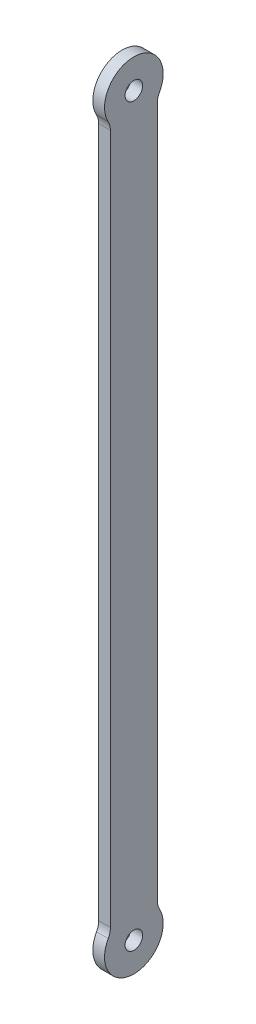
ISO-10303-21;
HEADER;
FILE_DESCRIPTION(('STEP AP214'),'2;1');
FILE_NAME('part.step','',(''),(''),'','','');
FILE_SCHEMA(('AUTOMOTIVE_DESIGN { 1 0 10303 214 1 1 1 1 }'));
ENDSEC;
DATA;
#1=APPLICATION_CONTEXT('core data for automotive mechanical design processes');
#2=APPLICATION_PROTOCOL_DEFINITION('international standard','automotive_design',2000,#1);
#3=PRODUCT_CONTEXT('',#1,'mechanical');
#4=PRODUCT('Part','Part','',(#3));
#5=PRODUCT_RELATED_PRODUCT_CATEGORY('part','',(#4));
#6=PRODUCT_DEFINITION_FORMATION('','',#4);
#7=PRODUCT_DEFINITION_CONTEXT('part definition',#1,'design');
#8=PRODUCT_DEFINITION('design','',#6,#7);
#9=PRODUCT_DEFINITION_SHAPE('','',#8);
#10=(LENGTH_UNIT() NAMED_UNIT(*) SI_UNIT(.MILLI.,.METRE.));
#11=(NAMED_UNIT(*) PLANE_ANGLE_UNIT() SI_UNIT($,.RADIAN.));
#12=(NAMED_UNIT(*) SI_UNIT($,.STERADIAN.) SOLID_ANGLE_UNIT());
#13=UNCERTAINTY_MEASURE_WITH_UNIT(LENGTH_MEASURE(1.E-05),#10,'distance_accuracy_value','');
#14=(GEOMETRIC_REPRESENTATION_CONTEXT(3) GLOBAL_UNCERTAINTY_ASSIGNED_CONTEXT((#13)) GLOBAL_UNIT_ASSIGNED_CONTEXT((#10,
#11,#12)) REPRESENTATION_CONTEXT('',''));
#15=CARTESIAN_POINT('',(0.,0.,0.));
#16=DIRECTION('',(0.,0.,1.));
#17=DIRECTION('',(1.,0.,0.));
#18=AXIS2_PLACEMENT_3D('',#15,#16,#17);
#19=CARTESIAN_POINT('',(2.,0.,0.));
#20=DIRECTION('',(1.,0.,0.));
#21=DIRECTION('',(0.,0.,-1.));
#22=AXIS2_PLACEMENT_3D('',#19,#20,#21);
#23=PLANE('',#22);
#24=CARTESIAN_POINT('',(2.,125.52,0.));
#25=DIRECTION('',(1.,0.,0.));
#26=DIRECTION('',(0.,0.,-1.));
#27=AXIS2_PLACEMENT_3D('',#24,#25,#26);
#28=CIRCLE('',#27,5.);
#29=CARTESIAN_POINT('',(2.,123.09938540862,-4.375));
#30=VERTEX_POINT('',#29);
#31=CARTESIAN_POINT('',(2.,123.09938540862,4.375));
#32=VERTEX_POINT('',#31);
#33=EDGE_CURVE('E191',#30,#32,#28,.T.);
#34=ORIENTED_EDGE('',*,*,#33,.T.);
#35=CARTESIAN_POINT('',(2.,121.647016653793,7.));
#36=DIRECTION('',(1.,0.,0.));
#37=DIRECTION('',(0.,0.,-1.));
#38=AXIS2_PLACEMENT_3D('',#35,#36,#37);
#39=CIRCLE('',#38,3.);
#40=CARTESIAN_POINT('',(2.,121.647016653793,4.));
#41=VERTEX_POINT('',#40);
#42=EDGE_CURVE('E11',#32,#41,#39,.F.);
#43=ORIENTED_EDGE('',*,*,#42,.T.);
#44=DIRECTION('',(0.,-1.,0.));
#45=VECTOR('',#44,1.);
#46=CARTESIAN_POINT('',(2.,0.,4.));
#47=LINE('',#46,#45);
#48=CARTESIAN_POINT('',(2.,3.87298334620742,4.));
#49=VERTEX_POINT('',#48);
#50=EDGE_CURVE('E123',#41,#49,#47,.T.);
#51=ORIENTED_EDGE('',*,*,#50,.T.);
#52=CARTESIAN_POINT('',(2.,3.87298334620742,7.));
#53=DIRECTION('',(1.,0.,0.));
#54=DIRECTION('',(0.,0.,-1.));
#55=AXIS2_PLACEMENT_3D('',#52,#53,#54);
#56=CIRCLE('',#55,3.);
#57=CARTESIAN_POINT('',(2.,2.42061459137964,4.375));
#58=VERTEX_POINT('',#57);
#59=EDGE_CURVE('E166',#49,#58,#56,.F.);
#60=ORIENTED_EDGE('',*,*,#59,.T.);
#61=CARTESIAN_POINT('',(2.,0.,0.));
#62=DIRECTION('',(1.,0.,0.));
#63=DIRECTION('',(0.,0.,-1.));
#64=AXIS2_PLACEMENT_3D('',#61,#62,#63);
#65=CIRCLE('',#64,5.);
#66=CARTESIAN_POINT('',(2.,2.42061459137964,-4.375));
#67=VERTEX_POINT('',#66);
#68=EDGE_CURVE('E193',#58,#67,#65,.T.);
#69=ORIENTED_EDGE('',*,*,#68,.T.);
#70=CARTESIAN_POINT('',(2.,3.87298334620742,-7.));
#71=DIRECTION('',(1.,0.,0.));
#72=DIRECTION('',(0.,0.,-1.));
#73=AXIS2_PLACEMENT_3D('',#70,#71,#72);
#74=CIRCLE('',#73,3.);
#75=CARTESIAN_POINT('',(2.,3.87298334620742,-4.));
#76=VERTEX_POINT('',#75);
#77=EDGE_CURVE('E174',#67,#76,#74,.F.);
#78=ORIENTED_EDGE('',*,*,#77,.T.);
#79=DIRECTION('',(0.,1.,0.));
#80=VECTOR('',#79,1.);
#81=CARTESIAN_POINT('',(2.,0.,-4.));
#82=LINE('',#81,#80);
#83=CARTESIAN_POINT('',(2.,121.647016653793,-4.));
#84=VERTEX_POINT('',#83);
#85=EDGE_CURVE('E134',#76,#84,#82,.T.);
#86=ORIENTED_EDGE('',*,*,#85,.T.);
#87=CARTESIAN_POINT('',(2.,121.647016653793,-7.));
#88=DIRECTION('',(1.,0.,0.));
#89=DIRECTION('',(0.,0.,-1.));
#90=AXIS2_PLACEMENT_3D('',#87,#88,#89);
#91=CIRCLE('',#90,3.);
#92=EDGE_CURVE('E65',#84,#30,#91,.F.);
#93=ORIENTED_EDGE('',*,*,#92,.T.);
#94=EDGE_LOOP('',(#34,#43,#51,#60,#69,#78,#86,#93));
#95=FACE_BOUND('',#94,.T.);
#96=CARTESIAN_POINT('',(2.,125.52,0.));
#97=DIRECTION('',(1.,0.,0.));
#98=DIRECTION('',(0.,0.,-1.));
#99=AXIS2_PLACEMENT_3D('',#96,#97,#98);
#100=CIRCLE('',#99,1.5);
#101=CARTESIAN_POINT('',(2.,125.52,-1.5));
#102=VERTEX_POINT('',#101);
#103=EDGE_CURVE('E141',#102,#102,#100,.T.);
#104=ORIENTED_EDGE('',*,*,#103,.F.);
#105=EDGE_LOOP('',(#104));
#106=FACE_BOUND('',#105,.T.);
#107=CARTESIAN_POINT('',(2.,0.,0.));
#108=DIRECTION('',(1.,0.,0.));
#109=DIRECTION('',(0.,0.,-1.));
#110=AXIS2_PLACEMENT_3D('',#107,#108,#109);
#111=CIRCLE('',#110,1.5);
#112=CARTESIAN_POINT('',(2.,0.,-1.5));
#113=VERTEX_POINT('',#112);
#114=EDGE_CURVE('E204',#113,#113,#111,.T.);
#115=ORIENTED_EDGE('',*,*,#114,.F.);
#116=EDGE_LOOP('',(#115));
#117=FACE_BOUND('',#116,.T.);
#118=ADVANCED_FACE('F42',(#95,#106,#117),#23,.T.);
#119=CARTESIAN_POINT('',(0.,0.,0.));
#120=DIRECTION('',(1.,0.,0.));
#121=DIRECTION('',(0.,0.,-1.));
#122=AXIS2_PLACEMENT_3D('',#119,#120,#121);
#123=PLANE('',#122);
#124=DIRECTION('',(0.,1.,0.));
#125=VECTOR('',#124,1.);
#126=CARTESIAN_POINT('',(0.,0.,-4.));
#127=LINE('',#126,#125);
#128=CARTESIAN_POINT('',(0.,3.87298334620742,-4.));
#129=VERTEX_POINT('',#128);
#130=CARTESIAN_POINT('',(0.,121.647016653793,-4.));
#131=VERTEX_POINT('',#130);
#132=EDGE_CURVE('E135',#129,#131,#127,.T.);
#133=ORIENTED_EDGE('',*,*,#132,.F.);
#134=CARTESIAN_POINT('',(0.,3.87298334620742,-7.));
#135=DIRECTION('',(1.,0.,0.));
#136=DIRECTION('',(0.,0.,-1.));
#137=AXIS2_PLACEMENT_3D('',#134,#135,#136);
#138=CIRCLE('',#137,3.);
#139=CARTESIAN_POINT('',(0.,2.42061459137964,-4.375));
#140=VERTEX_POINT('',#139);
#141=EDGE_CURVE('E171',#129,#140,#138,.T.);
#142=ORIENTED_EDGE('',*,*,#141,.T.);
#143=CARTESIAN_POINT('',(0.,0.,0.));
#144=DIRECTION('',(1.,0.,0.));
#145=DIRECTION('',(0.,0.,-1.));
#146=AXIS2_PLACEMENT_3D('',#143,#144,#145);
#147=CIRCLE('',#146,5.);
#148=CARTESIAN_POINT('',(0.,2.42061459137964,4.375));
#149=VERTEX_POINT('',#148);
#150=EDGE_CURVE('E200',#140,#149,#147,.F.);
#151=ORIENTED_EDGE('',*,*,#150,.T.);
#152=CARTESIAN_POINT('',(0.,3.87298334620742,7.));
#153=DIRECTION('',(1.,0.,0.));
#154=DIRECTION('',(0.,0.,-1.));
#155=AXIS2_PLACEMENT_3D('',#152,#153,#154);
#156=CIRCLE('',#155,3.);
#157=CARTESIAN_POINT('',(0.,3.87298334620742,4.));
#158=VERTEX_POINT('',#157);
#159=EDGE_CURVE('E132',#149,#158,#156,.T.);
#160=ORIENTED_EDGE('',*,*,#159,.T.);
#161=DIRECTION('',(0.,-1.,0.));
#162=VECTOR('',#161,1.);
#163=CARTESIAN_POINT('',(0.,0.,4.));
#164=LINE('',#163,#162);
#165=CARTESIAN_POINT('',(0.,121.647016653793,4.));
#166=VERTEX_POINT('',#165);
#167=EDGE_CURVE('E120',#166,#158,#164,.T.);
#168=ORIENTED_EDGE('',*,*,#167,.F.);
#169=CARTESIAN_POINT('',(0.,121.647016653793,7.));
#170=DIRECTION('',(1.,0.,0.));
#171=DIRECTION('',(0.,0.,-1.));
#172=AXIS2_PLACEMENT_3D('',#169,#170,#171);
#173=CIRCLE('',#172,3.);
#174=CARTESIAN_POINT('',(0.,123.09938540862,4.375));
#175=VERTEX_POINT('',#174);
#176=EDGE_CURVE('E51',#166,#175,#173,.T.);
#177=ORIENTED_EDGE('',*,*,#176,.T.);
#178=CARTESIAN_POINT('',(0.,125.52,0.));
#179=DIRECTION('',(1.,0.,0.));
#180=DIRECTION('',(0.,0.,-1.));
#181=AXIS2_PLACEMENT_3D('',#178,#179,#180);
#182=CIRCLE('',#181,5.);
#183=CARTESIAN_POINT('',(0.,123.09938540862,-4.375));
#184=VERTEX_POINT('',#183);
#185=EDGE_CURVE('E181',#175,#184,#182,.F.);
#186=ORIENTED_EDGE('',*,*,#185,.T.);
#187=CARTESIAN_POINT('',(0.,121.647016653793,-7.));
#188=DIRECTION('',(1.,0.,0.));
#189=DIRECTION('',(0.,0.,-1.));
#190=AXIS2_PLACEMENT_3D('',#187,#188,#189);
#191=CIRCLE('',#190,3.);
#192=EDGE_CURVE('E114',#184,#131,#191,.T.);
#193=ORIENTED_EDGE('',*,*,#192,.T.);
#194=EDGE_LOOP('',(#133,#142,#151,#160,#168,#177,#186,#193));
#195=FACE_BOUND('',#194,.T.);
#196=CARTESIAN_POINT('',(0.,125.52,0.));
#197=DIRECTION('',(1.,0.,0.));
#198=DIRECTION('',(0.,0.,-1.));
#199=AXIS2_PLACEMENT_3D('',#196,#197,#198);
#200=CIRCLE('',#199,1.5);
#201=CARTESIAN_POINT('',(0.,125.52,-1.5));
#202=VERTEX_POINT('',#201);
#203=EDGE_CURVE('E208',#202,#202,#200,.T.);
#204=ORIENTED_EDGE('',*,*,#203,.T.);
#205=EDGE_LOOP('',(#204));
#206=FACE_BOUND('',#205,.T.);
#207=CARTESIAN_POINT('',(0.,0.,0.));
#208=DIRECTION('',(1.,0.,0.));
#209=DIRECTION('',(0.,0.,-1.));
#210=AXIS2_PLACEMENT_3D('',#207,#208,#209);
#211=CIRCLE('',#210,1.5);
#212=CARTESIAN_POINT('',(0.,0.,-1.5));
#213=VERTEX_POINT('',#212);
#214=EDGE_CURVE('E197',#213,#213,#211,.T.);
#215=ORIENTED_EDGE('',*,*,#214,.T.);
#216=EDGE_LOOP('',(#215));
#217=FACE_BOUND('',#216,.T.);
#218=ADVANCED_FACE('F128',(#195,#206,#217),#123,.F.);
#219=CARTESIAN_POINT('',(2.,0.,-4.));
#220=DIRECTION('',(0.,0.,1.));
#221=DIRECTION('',(1.,0.,0.));
#222=AXIS2_PLACEMENT_3D('',#219,#220,#221);
#223=PLANE('',#222);
#224=ORIENTED_EDGE('',*,*,#85,.F.);
#225=DIRECTION('',(1.,0.,0.));
#226=VECTOR('',#225,1.);
#227=CARTESIAN_POINT('',(2.,3.87298334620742,-4.));
#228=LINE('',#227,#226);
#229=EDGE_CURVE('E157',#76,#129,#228,.F.);
#230=ORIENTED_EDGE('',*,*,#229,.T.);
#231=ORIENTED_EDGE('',*,*,#132,.T.);
#232=DIRECTION('',(1.,0.,0.));
#233=VECTOR('',#232,1.);
#234=CARTESIAN_POINT('',(2.,121.647016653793,-4.));
#235=LINE('',#234,#233);
#236=EDGE_CURVE('E153',#131,#84,#235,.T.);
#237=ORIENTED_EDGE('',*,*,#236,.T.);
#238=EDGE_LOOP('',(#224,#230,#231,#237));
#239=FACE_BOUND('',#238,.T.);
#240=ADVANCED_FACE('F187',(#239),#223,.F.);
#241=CARTESIAN_POINT('',(2.,0.,4.));
#242=DIRECTION('',(0.,0.,-1.));
#243=DIRECTION('',(-1.,0.,0.));
#244=AXIS2_PLACEMENT_3D('',#241,#242,#243);
#245=PLANE('',#244);
#246=ORIENTED_EDGE('',*,*,#167,.T.);
#247=DIRECTION('',(1.,0.,0.));
#248=VECTOR('',#247,1.);
#249=CARTESIAN_POINT('',(2.,3.87298334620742,4.));
#250=LINE('',#249,#248);
#251=EDGE_CURVE('E125',#158,#49,#250,.T.);
#252=ORIENTED_EDGE('',*,*,#251,.T.);
#253=ORIENTED_EDGE('',*,*,#50,.F.);
#254=DIRECTION('',(1.,0.,0.));
#255=VECTOR('',#254,1.);
#256=CARTESIAN_POINT('',(2.,121.647016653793,4.));
#257=LINE('',#256,#255);
#258=EDGE_CURVE('E109',#41,#166,#257,.F.);
#259=ORIENTED_EDGE('',*,*,#258,.T.);
#260=EDGE_LOOP('',(#246,#252,#253,#259));
#261=FACE_BOUND('',#260,.T.);
#262=ADVANCED_FACE('F118',(#261),#245,.F.);
#263=CARTESIAN_POINT('',(2.,125.52,0.));
#264=DIRECTION('',(-1.,0.,0.));
#265=DIRECTION('',(0.,0.,1.));
#266=AXIS2_PLACEMENT_3D('',#263,#264,#265);
#267=CYLINDRICAL_SURFACE('',#266,1.5);
#268=ORIENTED_EDGE('',*,*,#103,.T.);
#269=EDGE_LOOP('',(#268));
#270=FACE_BOUND('',#269,.T.);
#271=ORIENTED_EDGE('',*,*,#203,.F.);
#272=EDGE_LOOP('',(#271));
#273=FACE_BOUND('',#272,.T.);
#274=ADVANCED_FACE('F246',(#270,#273),#267,.F.);
#275=CARTESIAN_POINT('',(2.,0.,0.));
#276=DIRECTION('',(-1.,0.,0.));
#277=DIRECTION('',(0.,0.,1.));
#278=AXIS2_PLACEMENT_3D('',#275,#276,#277);
#279=CYLINDRICAL_SURFACE('',#278,1.5);
#280=ORIENTED_EDGE('',*,*,#114,.T.);
#281=EDGE_LOOP('',(#280));
#282=FACE_BOUND('',#281,.T.);
#283=ORIENTED_EDGE('',*,*,#214,.F.);
#284=EDGE_LOOP('',(#283));
#285=FACE_BOUND('',#284,.T.);
#286=ADVANCED_FACE('F266',(#282,#285),#279,.F.);
#287=CARTESIAN_POINT('',(-14.142135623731,125.52,0.));
#288=DIRECTION('',(1.,0.,0.));
#289=DIRECTION('',(0.,0.,-1.));
#290=AXIS2_PLACEMENT_3D('',#287,#288,#289);
#291=CYLINDRICAL_SURFACE('',#290,5.);
#292=ORIENTED_EDGE('',*,*,#33,.F.);
#293=DIRECTION('',(1.,0.,0.));
#294=VECTOR('',#293,1.);
#295=CARTESIAN_POINT('',(-14.142135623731,123.09938540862,-4.375));
#296=LINE('',#295,#294);
#297=EDGE_CURVE('E163',#30,#184,#296,.F.);
#298=ORIENTED_EDGE('',*,*,#297,.T.);
#299=ORIENTED_EDGE('',*,*,#185,.F.);
#300=DIRECTION('',(1.,0.,0.));
#301=VECTOR('',#300,1.);
#302=CARTESIAN_POINT('',(-14.142135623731,123.09938540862,4.375));
#303=LINE('',#302,#301);
#304=EDGE_CURVE('E58',#175,#32,#303,.T.);
#305=ORIENTED_EDGE('',*,*,#304,.T.);
#306=EDGE_LOOP('',(#292,#298,#299,#305));
#307=FACE_BOUND('',#306,.T.);
#308=ADVANCED_FACE('F190',(#307),#291,.T.);
#309=CARTESIAN_POINT('',(-14.142135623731,0.,0.));
#310=DIRECTION('',(1.,0.,0.));
#311=DIRECTION('',(0.,0.,-1.));
#312=AXIS2_PLACEMENT_3D('',#309,#310,#311);
#313=CYLINDRICAL_SURFACE('',#312,5.);
#314=ORIENTED_EDGE('',*,*,#68,.F.);
#315=DIRECTION('',(1.,0.,0.));
#316=VECTOR('',#315,1.);
#317=CARTESIAN_POINT('',(-14.142135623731,2.42061459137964,4.375));
#318=LINE('',#317,#316);
#319=EDGE_CURVE('E150',#58,#149,#318,.F.);
#320=ORIENTED_EDGE('',*,*,#319,.T.);
#321=ORIENTED_EDGE('',*,*,#150,.F.);
#322=DIRECTION('',(1.,0.,0.));
#323=VECTOR('',#322,1.);
#324=CARTESIAN_POINT('',(-14.142135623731,2.42061459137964,-4.375));
#325=LINE('',#324,#323);
#326=EDGE_CURVE('E147',#140,#67,#325,.T.);
#327=ORIENTED_EDGE('',*,*,#326,.T.);
#328=EDGE_LOOP('',(#314,#320,#321,#327));
#329=FACE_BOUND('',#328,.T.);
#330=ADVANCED_FACE('F224',(#329),#313,.T.);
#331=CARTESIAN_POINT('',(-14.142135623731,3.87298334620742,7.));
#332=DIRECTION('',(1.,0.,0.));
#333=DIRECTION('',(0.,0.,-1.));
#334=AXIS2_PLACEMENT_3D('',#331,#332,#333);
#335=CYLINDRICAL_SURFACE('',#334,3.);
#336=ORIENTED_EDGE('',*,*,#159,.F.);
#337=ORIENTED_EDGE('',*,*,#319,.F.);
#338=ORIENTED_EDGE('',*,*,#59,.F.);
#339=ORIENTED_EDGE('',*,*,#251,.F.);
#340=EDGE_LOOP('',(#336,#337,#338,#339));
#341=FACE_BOUND('',#340,.T.);
#342=ADVANCED_FACE('F227',(#341),#335,.F.);
#343=CARTESIAN_POINT('',(-14.142135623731,3.87298334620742,-7.));
#344=DIRECTION('',(1.,0.,0.));
#345=DIRECTION('',(0.,0.,-1.));
#346=AXIS2_PLACEMENT_3D('',#343,#344,#345);
#347=CYLINDRICAL_SURFACE('',#346,3.);
#348=ORIENTED_EDGE('',*,*,#77,.F.);
#349=ORIENTED_EDGE('',*,*,#326,.F.);
#350=ORIENTED_EDGE('',*,*,#141,.F.);
#351=ORIENTED_EDGE('',*,*,#229,.F.);
#352=EDGE_LOOP('',(#348,#349,#350,#351));
#353=FACE_BOUND('',#352,.T.);
#354=ADVANCED_FACE('F229',(#353),#347,.F.);
#355=CARTESIAN_POINT('',(-14.142135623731,121.647016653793,-7.));
#356=DIRECTION('',(1.,0.,0.));
#357=DIRECTION('',(0.,0.,-1.));
#358=AXIS2_PLACEMENT_3D('',#355,#356,#357);
#359=CYLINDRICAL_SURFACE('',#358,3.);
#360=ORIENTED_EDGE('',*,*,#192,.F.);
#361=ORIENTED_EDGE('',*,*,#297,.F.);
#362=ORIENTED_EDGE('',*,*,#92,.F.);
#363=ORIENTED_EDGE('',*,*,#236,.F.);
#364=EDGE_LOOP('',(#360,#361,#362,#363));
#365=FACE_BOUND('',#364,.T.);
#366=ADVANCED_FACE('F189',(#365),#359,.F.);
#367=CARTESIAN_POINT('',(-14.142135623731,121.647016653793,7.));
#368=DIRECTION('',(1.,0.,0.));
#369=DIRECTION('',(0.,0.,-1.));
#370=AXIS2_PLACEMENT_3D('',#367,#368,#369);
#371=CYLINDRICAL_SURFACE('',#370,3.);
#372=ORIENTED_EDGE('',*,*,#42,.F.);
#373=ORIENTED_EDGE('',*,*,#304,.F.);
#374=ORIENTED_EDGE('',*,*,#176,.F.);
#375=ORIENTED_EDGE('',*,*,#258,.F.);
#376=EDGE_LOOP('',(#372,#373,#374,#375));
#377=FACE_BOUND('',#376,.T.);
#378=ADVANCED_FACE('F44',(#377),#371,.F.);
#379=CLOSED_SHELL('',(#118,#218,#240,#262,#274,#286,#308,#330,#342,#354,#366,#378));
#380=MANIFOLD_SOLID_BREP('B2',#379);
#381=ADVANCED_BREP_SHAPE_REPRESENTATION('',(#18,#380),#14);
#382=SHAPE_DEFINITION_REPRESENTATION(#9,#381);
ENDSEC;
END-ISO-10303-21;
